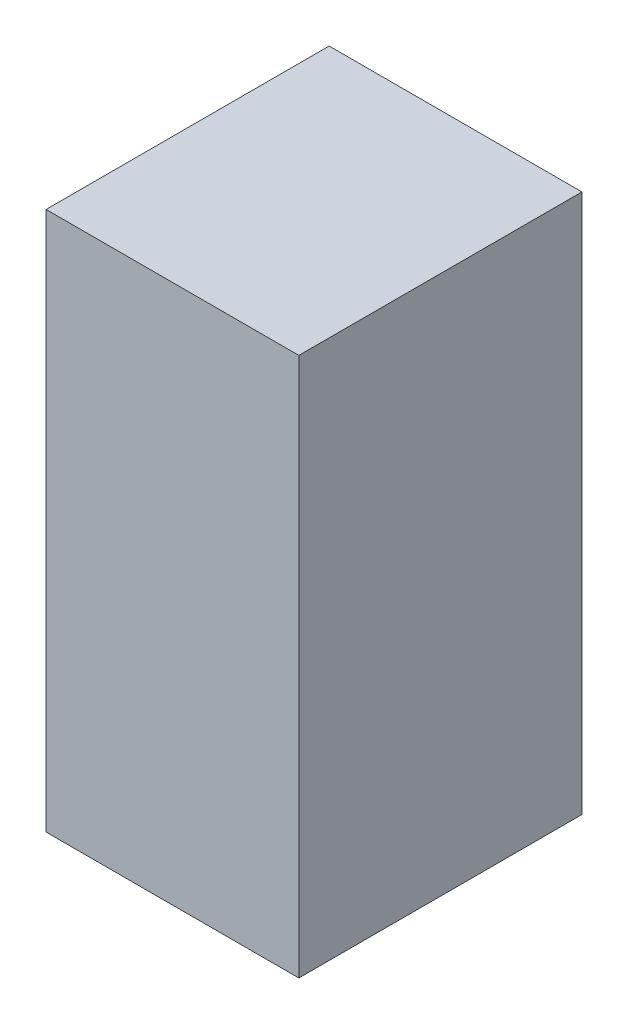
from build123d import *

# Parameters (mm, degrees)
SKETCH1_W      = 19.05
SKETCH1_H      = 21.336
EXTRUDE1_DEPTH = 40.64


with BuildPart() as part:
    # Sketch1 → Extrude1 (new body)
    with BuildSketch(Plane(origin=(0, 0, 0), x_dir=(1, 0, 0), z_dir=(0, 1, 0))):
        Rectangle(SKETCH1_W, SKETCH1_H)
    extrude(amount=EXTRUDE1_DEPTH)


solid = part.part
